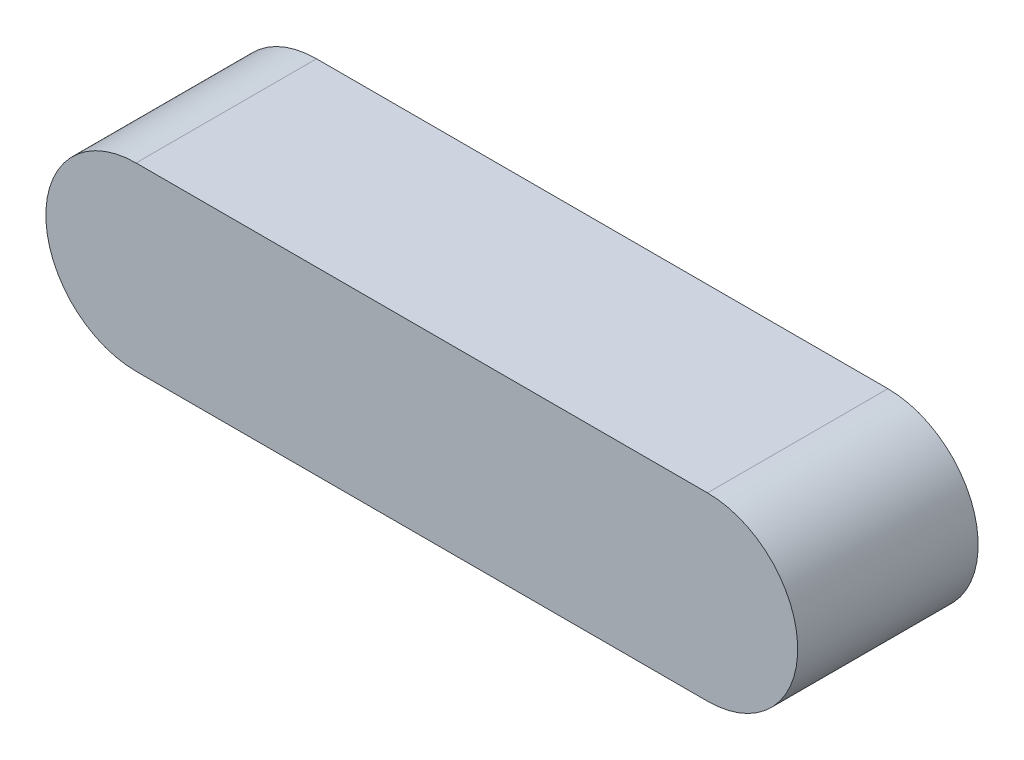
from build123d import *

# Parameters (mm, degrees)
EXTRUDE_1_DEPTH = 6


with BuildPart() as part:
    # Sketch 1 → Extrude 1 (new body)
    with BuildSketch(Plane.XY):
        with BuildLine():
            Line((70, 3), (89, 3))
            ThreePointArc((89, 3), (92, 0), (89, -3))
            Line((89, -3), (70, -3))
            ThreePointArc((70, -3), (67, 0), (70, 3))
        make_face()
    extrude(amount=EXTRUDE_1_DEPTH)


solid = part.part
